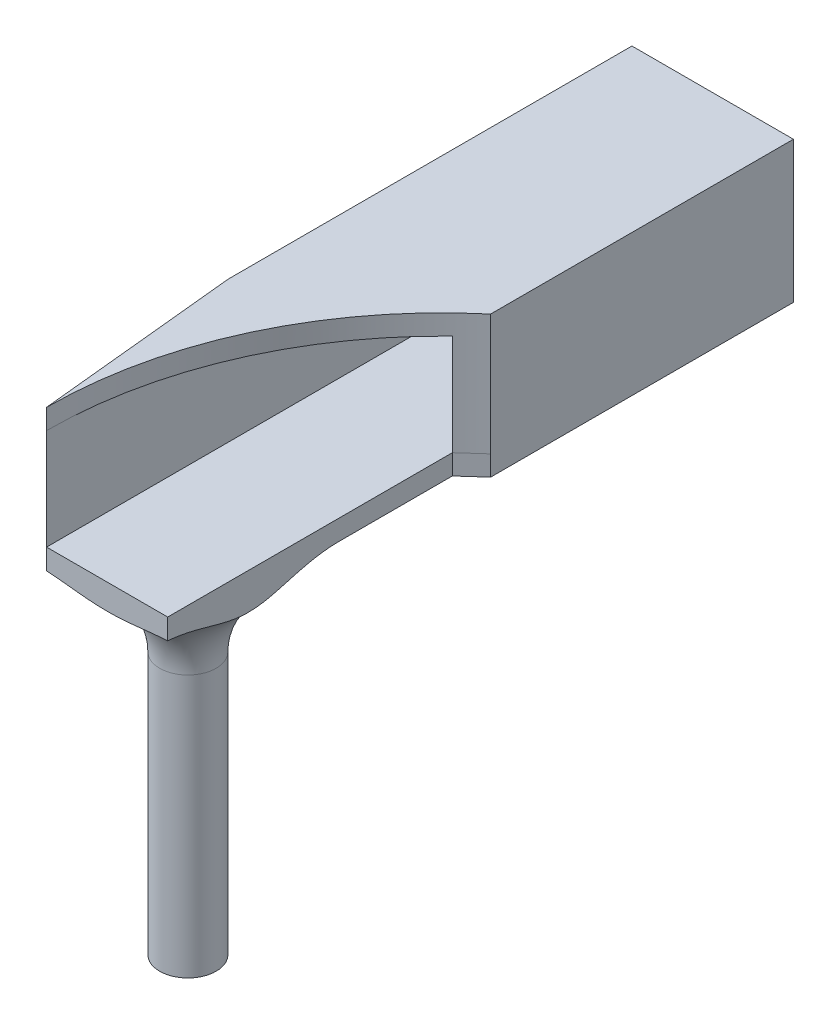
ISO-10303-21;
HEADER;
FILE_DESCRIPTION(('STEP AP214'),'2;1');
FILE_NAME('part.step','',(''),(''),'','','');
FILE_SCHEMA(('AUTOMOTIVE_DESIGN { 1 0 10303 214 1 1 1 1 }'));
ENDSEC;
DATA;
#1=APPLICATION_CONTEXT('core data for automotive mechanical design processes');
#2=APPLICATION_PROTOCOL_DEFINITION('international standard','automotive_design',2000,#1);
#3=PRODUCT_CONTEXT('',#1,'mechanical');
#4=PRODUCT('Part','Part','',(#3));
#5=PRODUCT_RELATED_PRODUCT_CATEGORY('part','',(#4));
#6=PRODUCT_DEFINITION_FORMATION('','',#4);
#7=PRODUCT_DEFINITION_CONTEXT('part definition',#1,'design');
#8=PRODUCT_DEFINITION('design','',#6,#7);
#9=PRODUCT_DEFINITION_SHAPE('','',#8);
#10=(LENGTH_UNIT() NAMED_UNIT(*) SI_UNIT(.MILLI.,.METRE.));
#11=(NAMED_UNIT(*) PLANE_ANGLE_UNIT() SI_UNIT($,.RADIAN.));
#12=(NAMED_UNIT(*) SI_UNIT($,.STERADIAN.) SOLID_ANGLE_UNIT());
#13=UNCERTAINTY_MEASURE_WITH_UNIT(LENGTH_MEASURE(1.E-05),#10,'distance_accuracy_value','');
#14=(GEOMETRIC_REPRESENTATION_CONTEXT(3) GLOBAL_UNCERTAINTY_ASSIGNED_CONTEXT((#13)) GLOBAL_UNIT_ASSIGNED_CONTEXT((#10,
#11,#12)) REPRESENTATION_CONTEXT('',''));
#15=CARTESIAN_POINT('',(0.,0.,0.));
#16=DIRECTION('',(0.,0.,1.));
#17=DIRECTION('',(1.,0.,0.));
#18=AXIS2_PLACEMENT_3D('',#15,#16,#17);
#19=CARTESIAN_POINT('',(-1.99999999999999,-1.75,15.));
#20=DIRECTION('',(0.,1.,0.));
#21=DIRECTION('',(0.,0.,1.));
#22=AXIS2_PLACEMENT_3D('',#19,#20,#21);
#23=PLANE('',#22);
#24=DIRECTION('',(0.,0.,-1.));
#25=VECTOR('',#24,1.);
#26=CARTESIAN_POINT('',(1.5,-1.75,7.94916418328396));
#27=LINE('',#26,#25);
#28=CARTESIAN_POINT('',(1.5,-1.75,10.7550055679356));
#29=VERTEX_POINT('',#28);
#30=CARTESIAN_POINT('',(1.5,-1.75,7.94916418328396));
#31=VERTEX_POINT('',#30);
#32=EDGE_CURVE('E149',#29,#31,#27,.T.);
#33=ORIENTED_EDGE('',*,*,#32,.F.);
#34=CARTESIAN_POINT('',(0.,-1.75,13.));
#35=DIRECTION('',(0.,1.,0.));
#36=DIRECTION('',(0.,0.,1.));
#37=AXIS2_PLACEMENT_3D('',#34,#35,#36);
#38=CIRCLE('',#37,2.7);
#39=CARTESIAN_POINT('',(-1.89256665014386,-1.75,11.0743334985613));
#40=VERTEX_POINT('',#39);
#41=EDGE_CURVE('E245',#29,#40,#38,.T.);
#42=ORIENTED_EDGE('',*,*,#41,.T.);
#43=DIRECTION('',(0.0995037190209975,0.,0.995037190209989));
#44=VECTOR('',#43,1.);
#45=CARTESIAN_POINT('',(-1.99999999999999,-1.75,9.99999999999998));
#46=LINE('',#45,#44);
#47=CARTESIAN_POINT('',(-1.99999999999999,-1.75,9.99999999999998));
#48=VERTEX_POINT('',#47);
#49=EDGE_CURVE('E310',#48,#40,#46,.T.);
#50=ORIENTED_EDGE('',*,*,#49,.F.);
#51=DIRECTION('',(0.,0.,-1.));
#52=VECTOR('',#51,1.);
#53=CARTESIAN_POINT('',(-1.99999999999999,-1.75,15.));
#54=LINE('',#53,#52);
#55=CARTESIAN_POINT('',(-1.99999999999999,-1.75,0.));
#56=VERTEX_POINT('',#55);
#57=EDGE_CURVE('E262',#48,#56,#54,.T.);
#58=ORIENTED_EDGE('',*,*,#57,.T.);
#59=DIRECTION('',(1.,0.,0.));
#60=VECTOR('',#59,1.);
#61=CARTESIAN_POINT('',(-1.99999999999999,-1.75,0.));
#62=LINE('',#61,#60);
#63=CARTESIAN_POINT('',(2.00000000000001,-1.75,0.));
#64=VERTEX_POINT('',#63);
#65=EDGE_CURVE('E302',#56,#64,#62,.T.);
#66=ORIENTED_EDGE('',*,*,#65,.T.);
#67=DIRECTION('',(0.,0.,-1.));
#68=VECTOR('',#67,1.);
#69=CARTESIAN_POINT('',(2.00000000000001,-1.75,15.));
#70=LINE('',#69,#68);
#71=CARTESIAN_POINT('',(2.00000000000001,-1.75,7.5));
#72=VERTEX_POINT('',#71);
#73=EDGE_CURVE('E305',#72,#64,#70,.T.);
#74=ORIENTED_EDGE('',*,*,#73,.F.);
#75=DIRECTION('',(0.743912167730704,0.,-0.668277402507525));
#76=VECTOR('',#75,1.);
#77=CARTESIAN_POINT('',(2.00000000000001,-1.75,7.5));
#78=LINE('',#77,#76);
#79=EDGE_CURVE('E319',#31,#72,#78,.T.);
#80=ORIENTED_EDGE('',*,*,#79,.F.);
#81=EDGE_LOOP('',(#33,#42,#50,#58,#66,#74,#80));
#82=FACE_BOUND('',#81,.T.);
#83=ADVANCED_FACE('F52',(#82),#23,.F.);
#84=CARTESIAN_POINT('',(-1.5,-1.25,15.));
#85=DIRECTION('',(0.,1.,0.));
#86=DIRECTION('',(0.,0.,1.));
#87=AXIS2_PLACEMENT_3D('',#84,#85,#86);
#88=PLANE('',#87);
#89=DIRECTION('',(0.,0.,1.));
#90=VECTOR('',#89,1.);
#91=CARTESIAN_POINT('',(1.5,-1.25,7.94916418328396));
#92=LINE('',#91,#90);
#93=CARTESIAN_POINT('',(1.5,-1.25,7.94916418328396));
#94=VERTEX_POINT('',#93);
#95=CARTESIAN_POINT('',(1.5,-1.25,15.));
#96=VERTEX_POINT('',#95);
#97=EDGE_CURVE('E147',#94,#96,#92,.T.);
#98=ORIENTED_EDGE('',*,*,#97,.F.);
#99=DIRECTION('',(0.,0.,-1.));
#100=VECTOR('',#99,1.);
#101=CARTESIAN_POINT('',(1.5,-1.25,15.));
#102=LINE('',#101,#100);
#103=CARTESIAN_POINT('',(1.5,-1.25,0.));
#104=VERTEX_POINT('',#103);
#105=EDGE_CURVE('E171',#94,#104,#102,.T.);
#106=ORIENTED_EDGE('',*,*,#105,.T.);
#107=DIRECTION('',(1.,0.,0.));
#108=VECTOR('',#107,1.);
#109=CARTESIAN_POINT('',(-1.5,-1.25,0.));
#110=LINE('',#109,#108);
#111=CARTESIAN_POINT('',(-1.5,-1.25,0.));
#112=VERTEX_POINT('',#111);
#113=EDGE_CURVE('E281',#112,#104,#110,.T.);
#114=ORIENTED_EDGE('',*,*,#113,.F.);
#115=DIRECTION('',(0.,0.,-1.));
#116=VECTOR('',#115,1.);
#117=CARTESIAN_POINT('',(-1.5,-1.25,15.));
#118=LINE('',#117,#116);
#119=CARTESIAN_POINT('',(-1.5,-1.25,15.));
#120=VERTEX_POINT('',#119);
#121=EDGE_CURVE('E189',#120,#112,#118,.T.);
#122=ORIENTED_EDGE('',*,*,#121,.F.);
#123=DIRECTION('',(1.,0.,0.));
#124=VECTOR('',#123,1.);
#125=CARTESIAN_POINT('',(-1.5,-1.25,15.));
#126=LINE('',#125,#124);
#127=EDGE_CURVE('E174',#120,#96,#126,.T.);
#128=ORIENTED_EDGE('',*,*,#127,.T.);
#129=EDGE_LOOP('',(#98,#106,#114,#122,#128));
#130=FACE_BOUND('',#129,.T.);
#131=ADVANCED_FACE('F168',(#130),#88,.T.);
#132=CARTESIAN_POINT('',(0.,0.,15.));
#133=DIRECTION('',(0.,0.,-1.));
#134=DIRECTION('',(-1.,0.,0.));
#135=AXIS2_PLACEMENT_3D('',#132,#133,#134);
#136=PLANE('',#135);
#137=DIRECTION('',(0.,1.,0.));
#138=VECTOR('',#137,1.);
#139=CARTESIAN_POINT('',(-1.5,-9.26664818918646,15.));
#140=LINE('',#139,#138);
#141=CARTESIAN_POINT('',(-1.5,-1.76002512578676,15.));
#142=VERTEX_POINT('',#141);
#143=EDGE_CURVE('E78',#142,#120,#140,.T.);
#144=ORIENTED_EDGE('',*,*,#143,.F.);
#145=CARTESIAN_POINT('',(-1.5,-1.76002512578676,15.));
#146=CARTESIAN_POINT('',(-1.44749116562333,-1.76318827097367,15.));
#147=CARTESIAN_POINT('',(-1.39502842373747,-1.7670047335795,15.));
#148=CARTESIAN_POINT('',(-1.29019303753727,-1.77560362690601,15.));
#149=CARTESIAN_POINT('',(-1.23782037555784,-1.78038583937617,15.));
#150=CARTESIAN_POINT('',(-1.08069813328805,-1.79568283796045,15.));
#151=CARTESIAN_POINT('',(-0.976045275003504,-1.80714059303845,15.));
#152=CARTESIAN_POINT('',(-0.767214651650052,-1.829520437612,15.));
#153=CARTESIAN_POINT('',(-0.66303715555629,-1.8404449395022,15.));
#154=CARTESIAN_POINT('',(-0.454415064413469,-1.85884743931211,15.));
#155=CARTESIAN_POINT('',(-0.349970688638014,-1.86632768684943,15.));
#156=CARTESIAN_POINT('',(-0.140760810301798,-1.87560473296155,15.));
#157=CARTESIAN_POINT('',(-0.0359951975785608,-1.87739929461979,15.));
#158=CARTESIAN_POINT('',(0.173473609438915,-1.87472029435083,15.));
#159=CARTESIAN_POINT('',(0.278176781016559,-1.87024513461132,15.));
#160=CARTESIAN_POINT('',(0.487207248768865,-1.85643734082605,15.));
#161=CARTESIAN_POINT('',(0.591534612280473,-1.8471056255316,15.));
#162=CARTESIAN_POINT('',(0.799959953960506,-1.82626937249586,15.));
#163=CARTESIAN_POINT('',(0.904057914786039,-1.81476467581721,15.));
#164=CARTESIAN_POINT('',(1.04910206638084,-1.79932440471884,15.));
#165=CARTESIAN_POINT('',(1.09000941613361,-1.79503500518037,15.));
#166=CARTESIAN_POINT('',(1.17184436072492,-1.78676159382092,15.));
#167=CARTESIAN_POINT('',(1.2127719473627,-1.78277750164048,15.));
#168=CARTESIAN_POINT('',(1.29471078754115,-1.77528064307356,15.));
#169=CARTESIAN_POINT('',(1.3357220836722,-1.77176833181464,15.));
#170=CARTESIAN_POINT('',(1.41781326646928,-1.76537906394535,15.));
#171=CARTESIAN_POINT('',(1.4588931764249,-1.76250240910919,15.));
#172=CARTESIAN_POINT('',(1.5,-1.76002512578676,15.));
#173=B_SPLINE_CURVE_WITH_KNOTS('',3,(#145,#146,#147,#148,#149,#150,#151,#152,#153,#154,#155,
#156,#157,#158,#159,#160,#161,#162,#163,#164,#165,#166,#167,#168,#169,#170,#171,#172),
.UNSPECIFIED.,.F.,.F.,(4,2,2,2,2,2,2,2,2,2,2,2,2,4),(0.,0.157798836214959,0.315562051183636,
0.631392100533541,0.945627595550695,1.2596575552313,1.57381104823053,1.88804461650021,
2.20221876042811,2.51641589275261,2.63981004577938,2.76317160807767,2.88665133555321,
3.01018955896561),.UNSPECIFIED.);
#174=CARTESIAN_POINT('',(1.5,-1.76002512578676,15.));
#175=VERTEX_POINT('',#174);
#176=EDGE_CURVE('E65',#142,#175,#173,.T.);
#177=ORIENTED_EDGE('',*,*,#176,.T.);
#178=DIRECTION('',(0.,1.,0.));
#179=VECTOR('',#178,1.);
#180=CARTESIAN_POINT('',(1.5,-9.26664818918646,15.));
#181=LINE('',#180,#179);
#182=EDGE_CURVE('E71',#175,#96,#181,.T.);
#183=ORIENTED_EDGE('',*,*,#182,.T.);
#184=ORIENTED_EDGE('',*,*,#127,.F.);
#185=EDGE_LOOP('',(#144,#177,#183,#184));
#186=FACE_BOUND('',#185,.T.);
#187=ADVANCED_FACE('F221',(#186),#136,.F.);
#188=CARTESIAN_POINT('',(0.,0.,0.));
#189=DIRECTION('',(0.,0.,-1.));
#190=DIRECTION('',(-1.,0.,0.));
#191=AXIS2_PLACEMENT_3D('',#188,#189,#190);
#192=PLANE('',#191);
#193=DIRECTION('',(0.,1.,0.));
#194=VECTOR('',#193,1.);
#195=CARTESIAN_POINT('',(2.00000000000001,-1.75,0.));
#196=LINE('',#195,#194);
#197=CARTESIAN_POINT('',(2.00000000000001,1.75,0.));
#198=VERTEX_POINT('',#197);
#199=EDGE_CURVE('E294',#64,#198,#196,.T.);
#200=ORIENTED_EDGE('',*,*,#199,.F.);
#201=ORIENTED_EDGE('',*,*,#65,.F.);
#202=DIRECTION('',(0.,-1.,0.));
#203=VECTOR('',#202,1.);
#204=CARTESIAN_POINT('',(-1.99999999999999,-1.75,0.));
#205=LINE('',#204,#203);
#206=CARTESIAN_POINT('',(-1.99999999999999,1.75,0.));
#207=VERTEX_POINT('',#206);
#208=EDGE_CURVE('E299',#207,#56,#205,.T.);
#209=ORIENTED_EDGE('',*,*,#208,.F.);
#210=DIRECTION('',(-1.,0.,0.));
#211=VECTOR('',#210,1.);
#212=CARTESIAN_POINT('',(-1.99999999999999,1.75,0.));
#213=LINE('',#212,#211);
#214=EDGE_CURVE('E297',#198,#207,#213,.T.);
#215=ORIENTED_EDGE('',*,*,#214,.F.);
#216=EDGE_LOOP('',(#200,#201,#209,#215));
#217=FACE_BOUND('',#216,.T.);
#218=ORIENTED_EDGE('',*,*,#113,.T.);
#219=DIRECTION('',(0.,1.,0.));
#220=VECTOR('',#219,1.);
#221=CARTESIAN_POINT('',(1.5,-1.25,0.));
#222=LINE('',#221,#220);
#223=CARTESIAN_POINT('',(1.5,1.25,0.));
#224=VERTEX_POINT('',#223);
#225=EDGE_CURVE('E184',#104,#224,#222,.T.);
#226=ORIENTED_EDGE('',*,*,#225,.T.);
#227=DIRECTION('',(-1.,0.,0.));
#228=VECTOR('',#227,1.);
#229=CARTESIAN_POINT('',(-1.5,1.25,0.));
#230=LINE('',#229,#228);
#231=CARTESIAN_POINT('',(-1.5,1.25,0.));
#232=VERTEX_POINT('',#231);
#233=EDGE_CURVE('E284',#224,#232,#230,.T.);
#234=ORIENTED_EDGE('',*,*,#233,.T.);
#235=DIRECTION('',(0.,-1.,0.));
#236=VECTOR('',#235,1.);
#237=CARTESIAN_POINT('',(-1.5,-1.25,0.));
#238=LINE('',#237,#236);
#239=EDGE_CURVE('E287',#232,#112,#238,.T.);
#240=ORIENTED_EDGE('',*,*,#239,.T.);
#241=EDGE_LOOP('',(#218,#226,#234,#240));
#242=FACE_BOUND('',#241,.T.);
#243=ADVANCED_FACE('F235',(#217,#242),#192,.T.);
#244=CARTESIAN_POINT('',(2.00000000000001,-1.75,15.));
#245=DIRECTION('',(-1.,0.,0.));
#246=DIRECTION('',(0.,0.,1.));
#247=AXIS2_PLACEMENT_3D('',#244,#245,#246);
#248=PLANE('',#247);
#249=DIRECTION('',(0.,1.,0.));
#250=VECTOR('',#249,1.);
#251=CARTESIAN_POINT('',(2.00000000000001,-9.52647267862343,7.5));
#252=LINE('',#251,#250);
#253=CARTESIAN_POINT('',(2.00000000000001,-1.25,7.5));
#254=VERTEX_POINT('',#253);
#255=CARTESIAN_POINT('',(2.00000000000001,1.75,7.5));
#256=VERTEX_POINT('',#255);
#257=EDGE_CURVE('E266',#254,#256,#252,.T.);
#258=ORIENTED_EDGE('',*,*,#257,.F.);
#259=DIRECTION('',(0.,1.,0.));
#260=VECTOR('',#259,1.);
#261=CARTESIAN_POINT('',(2.00000000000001,-9.26664818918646,7.5));
#262=LINE('',#261,#260);
#263=EDGE_CURVE('E152',#72,#254,#262,.T.);
#264=ORIENTED_EDGE('',*,*,#263,.F.);
#265=ORIENTED_EDGE('',*,*,#73,.T.);
#266=ORIENTED_EDGE('',*,*,#199,.T.);
#267=DIRECTION('',(0.,0.,-1.));
#268=VECTOR('',#267,1.);
#269=CARTESIAN_POINT('',(2.00000000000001,1.75,15.));
#270=LINE('',#269,#268);
#271=EDGE_CURVE('E252',#256,#198,#270,.T.);
#272=ORIENTED_EDGE('',*,*,#271,.F.);
#273=EDGE_LOOP('',(#258,#264,#265,#266,#272));
#274=FACE_BOUND('',#273,.T.);
#275=ADVANCED_FACE('F318',(#274),#248,.F.);
#276=CARTESIAN_POINT('',(-1.99999999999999,1.75,15.));
#277=DIRECTION('',(0.,-1.,0.));
#278=DIRECTION('',(0.,0.,-1.));
#279=AXIS2_PLACEMENT_3D('',#276,#277,#278);
#280=PLANE('',#279);
#281=DIRECTION('',(0.,0.,-1.));
#282=VECTOR('',#281,1.);
#283=CARTESIAN_POINT('',(-1.99999999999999,1.75,15.));
#284=LINE('',#283,#282);
#285=CARTESIAN_POINT('',(-1.99999999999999,1.75,9.99999999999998));
#286=VERTEX_POINT('',#285);
#287=EDGE_CURVE('E255',#286,#207,#284,.T.);
#288=ORIENTED_EDGE('',*,*,#287,.F.);
#289=DIRECTION('',(-0.0995037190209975,0.,-0.995037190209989));
#290=VECTOR('',#289,1.);
#291=CARTESIAN_POINT('',(-2.97029702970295,1.75,0.297029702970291));
#292=LINE('',#291,#290);
#293=CARTESIAN_POINT('',(-1.5,1.75,15.));
#294=VERTEX_POINT('',#293);
#295=EDGE_CURVE('E273',#294,#286,#292,.T.);
#296=ORIENTED_EDGE('',*,*,#295,.F.);
#297=CARTESIAN_POINT('',(8.28571428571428,1.75,15.));
#298=DIRECTION('',(0.,1.,0.));
#299=DIRECTION('',(0.,0.,1.));
#300=AXIS2_PLACEMENT_3D('',#297,#298,#299);
#301=CIRCLE('',#300,9.78571428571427);
#302=EDGE_CURVE('E269',#256,#294,#301,.T.);
#303=ORIENTED_EDGE('',*,*,#302,.F.);
#304=ORIENTED_EDGE('',*,*,#271,.T.);
#305=ORIENTED_EDGE('',*,*,#214,.T.);
#306=EDGE_LOOP('',(#288,#296,#303,#304,#305));
#307=FACE_BOUND('',#306,.T.);
#308=ADVANCED_FACE('F343',(#307),#280,.F.);
#309=CARTESIAN_POINT('',(-1.99999999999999,-1.75,15.));
#310=DIRECTION('',(1.,0.,0.));
#311=DIRECTION('',(0.,0.,-1.));
#312=AXIS2_PLACEMENT_3D('',#309,#310,#311);
#313=PLANE('',#312);
#314=ORIENTED_EDGE('',*,*,#57,.F.);
#315=DIRECTION('',(0.,1.,0.));
#316=VECTOR('',#315,1.);
#317=CARTESIAN_POINT('',(-1.99999999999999,-9.52647267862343,9.99999999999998));
#318=LINE('',#317,#316);
#319=EDGE_CURVE('E275',#48,#286,#318,.T.);
#320=ORIENTED_EDGE('',*,*,#319,.T.);
#321=ORIENTED_EDGE('',*,*,#287,.T.);
#322=ORIENTED_EDGE('',*,*,#208,.T.);
#323=EDGE_LOOP('',(#314,#320,#321,#322));
#324=FACE_BOUND('',#323,.T.);
#325=ADVANCED_FACE('F231',(#324),#313,.F.);
#326=CARTESIAN_POINT('',(1.5,-1.25,15.));
#327=DIRECTION('',(-1.,0.,0.));
#328=DIRECTION('',(0.,0.,1.));
#329=AXIS2_PLACEMENT_3D('',#326,#327,#328);
#330=PLANE('',#329);
#331=DIRECTION('',(0.,1.,0.));
#332=VECTOR('',#331,1.);
#333=CARTESIAN_POINT('',(1.5,-9.52647267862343,7.94916418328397));
#334=LINE('',#333,#332);
#335=CARTESIAN_POINT('',(1.5,1.25,7.94916418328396));
#336=VERTEX_POINT('',#335);
#337=EDGE_CURVE('E177',#336,#94,#334,.F.);
#338=ORIENTED_EDGE('',*,*,#337,.F.);
#339=DIRECTION('',(0.,0.,-1.));
#340=VECTOR('',#339,1.);
#341=CARTESIAN_POINT('',(1.5,1.25,15.));
#342=LINE('',#341,#340);
#343=EDGE_CURVE('E292',#336,#224,#342,.T.);
#344=ORIENTED_EDGE('',*,*,#343,.T.);
#345=ORIENTED_EDGE('',*,*,#225,.F.);
#346=ORIENTED_EDGE('',*,*,#105,.F.);
#347=EDGE_LOOP('',(#338,#344,#345,#346));
#348=FACE_BOUND('',#347,.T.);
#349=ADVANCED_FACE('F186',(#348),#330,.T.);
#350=CARTESIAN_POINT('',(-1.5,1.25,15.));
#351=DIRECTION('',(0.,-1.,0.));
#352=DIRECTION('',(0.,0.,-1.));
#353=AXIS2_PLACEMENT_3D('',#350,#351,#352);
#354=PLANE('',#353);
#355=CARTESIAN_POINT('',(8.28571428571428,1.25,15.));
#356=DIRECTION('',(0.,-1.,0.));
#357=DIRECTION('',(0.,0.,-1.));
#358=AXIS2_PLACEMENT_3D('',#355,#356,#357);
#359=CIRCLE('',#358,9.78571428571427);
#360=CARTESIAN_POINT('',(-1.5,1.25,15.));
#361=VERTEX_POINT('',#360);
#362=EDGE_CURVE('E181',#361,#336,#359,.T.);
#363=ORIENTED_EDGE('',*,*,#362,.F.);
#364=DIRECTION('',(0.,0.,-1.));
#365=VECTOR('',#364,1.);
#366=CARTESIAN_POINT('',(-1.5,1.25,15.));
#367=LINE('',#366,#365);
#368=EDGE_CURVE('E191',#361,#232,#367,.T.);
#369=ORIENTED_EDGE('',*,*,#368,.T.);
#370=ORIENTED_EDGE('',*,*,#233,.F.);
#371=ORIENTED_EDGE('',*,*,#343,.F.);
#372=EDGE_LOOP('',(#363,#369,#370,#371));
#373=FACE_BOUND('',#372,.T.);
#374=ADVANCED_FACE('F224',(#373),#354,.T.);
#375=CARTESIAN_POINT('',(-1.5,-1.25,15.));
#376=DIRECTION('',(1.,0.,0.));
#377=DIRECTION('',(0.,0.,-1.));
#378=AXIS2_PLACEMENT_3D('',#375,#376,#377);
#379=PLANE('',#378);
#380=ORIENTED_EDGE('',*,*,#239,.F.);
#381=ORIENTED_EDGE('',*,*,#368,.F.);
#382=DIRECTION('',(0.,-1.,0.));
#383=VECTOR('',#382,1.);
#384=CARTESIAN_POINT('',(-1.5,-1.25,15.));
#385=LINE('',#384,#383);
#386=EDGE_CURVE('E193',#361,#120,#385,.T.);
#387=ORIENTED_EDGE('',*,*,#386,.T.);
#388=ORIENTED_EDGE('',*,*,#121,.T.);
#389=EDGE_LOOP('',(#380,#381,#387,#388));
#390=FACE_BOUND('',#389,.T.);
#391=ADVANCED_FACE('F216',(#390),#379,.T.);
#392=CARTESIAN_POINT('',(8.28571428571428,-9.52647267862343,15.));
#393=DIRECTION('',(0.,1.,0.));
#394=DIRECTION('',(0.,0.,1.));
#395=AXIS2_PLACEMENT_3D('',#392,#393,#394);
#396=CYLINDRICAL_SURFACE('',#395,9.78571428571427);
#397=ORIENTED_EDGE('',*,*,#337,.T.);
#398=CARTESIAN_POINT('',(2.00000000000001,-1.25,7.5));
#399=DIRECTION('',(-0.743912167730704,0.,0.668277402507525));
#400=VECTOR('',#399,1.);
#401=LINE('',#398,#400);
#402=EDGE_CURVE('E155',#254,#94,#401,.T.);
#403=ORIENTED_EDGE('',*,*,#402,.F.);
#404=ORIENTED_EDGE('',*,*,#257,.T.);
#405=ORIENTED_EDGE('',*,*,#302,.T.);
#406=DIRECTION('',(0.,1.,0.));
#407=VECTOR('',#406,1.);
#408=CARTESIAN_POINT('',(-1.5,-9.52647267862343,15.));
#409=LINE('',#408,#407);
#410=EDGE_CURVE('E268',#361,#294,#409,.T.);
#411=ORIENTED_EDGE('',*,*,#410,.F.);
#412=ORIENTED_EDGE('',*,*,#362,.T.);
#413=EDGE_LOOP('',(#397,#403,#404,#405,#411,#412));
#414=FACE_BOUND('',#413,.T.);
#415=ADVANCED_FACE('F178',(#414),#396,.F.);
#416=CARTESIAN_POINT('',(-2.97029702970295,-9.52647267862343,0.297029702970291));
#417=DIRECTION('',(0.995037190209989,0.,-0.0995037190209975));
#418=DIRECTION('',(-0.0995037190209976,0.,-0.995037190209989));
#419=AXIS2_PLACEMENT_3D('',#416,#417,#418);
#420=PLANE('',#419);
#421=ORIENTED_EDGE('',*,*,#319,.F.);
#422=ORIENTED_EDGE('',*,*,#49,.T.);
#423=CARTESIAN_POINT('',(-1.89256665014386,-1.75,11.0743334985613));
#424=CARTESIAN_POINT('',(-1.88756723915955,-1.74999723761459,11.1243276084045));
#425=CARTESIAN_POINT('',(-1.88256902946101,-1.75115050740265,11.1743097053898));
#426=CARTESIAN_POINT('',(-1.87258408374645,-1.75554766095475,11.2741591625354));
#427=CARTESIAN_POINT('',(-1.86759734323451,-1.75879049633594,11.3240265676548));
#428=CARTESIAN_POINT('',(-1.85270236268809,-1.77128819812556,11.472976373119));
#429=CARTESIAN_POINT('',(-1.84281713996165,-1.78331602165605,11.5718286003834));
#430=CARTESIAN_POINT('',(-1.82306681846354,-1.81275699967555,11.7693318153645));
#431=CARTESIAN_POINT('',(-1.81320226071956,-1.83020438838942,11.8679773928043));
#432=CARTESIAN_POINT('',(-1.79351143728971,-1.86779781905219,12.0648856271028));
#433=CARTESIAN_POINT('',(-1.78368525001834,-1.88794782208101,12.1631474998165));
#434=CARTESIAN_POINT('',(-1.76403113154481,-1.92754252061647,12.3596886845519));
#435=CARTESIAN_POINT('',(-1.7542032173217,-1.94698805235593,12.4579678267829));
#436=CARTESIAN_POINT('',(-1.73446848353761,-1.98110093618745,12.6553151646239));
#437=CARTESIAN_POINT('',(-1.72456176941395,-1.99577383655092,12.7543823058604));
#438=CARTESIAN_POINT('',(-1.7096425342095,-2.01124330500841,12.9035746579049));
#439=CARTESIAN_POINT('',(-1.70466441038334,-2.01530903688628,12.9533558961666));
#440=CARTESIAN_POINT('',(-1.694694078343,-2.02095630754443,13.05305921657));
#441=CARTESIAN_POINT('',(-1.68970187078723,-2.02253796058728,13.1029812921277));
#442=CARTESIAN_POINT('',(-1.67971672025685,-2.02307454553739,13.2028327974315));
#443=CARTESIAN_POINT('',(-1.67472377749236,-2.02202985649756,13.2527622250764));
#444=CARTESIAN_POINT('',(-1.66474974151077,-2.01740849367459,13.3525025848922));
#445=CARTESIAN_POINT('',(-1.65976864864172,-2.01383174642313,13.4023135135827));
#446=CARTESIAN_POINT('',(-1.64839848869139,-2.00308906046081,13.516015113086));
#447=CARTESIAN_POINT('',(-1.64201643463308,-1.9951867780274,13.5798356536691));
#448=CARTESIAN_POINT('',(-1.62929240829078,-1.97663379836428,13.7070759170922));
#449=CARTESIAN_POINT('',(-1.62295044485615,-1.96598251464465,13.7704955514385));
#450=CARTESIAN_POINT('',(-1.61028432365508,-1.9430186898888,13.8971567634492));
#451=CARTESIAN_POINT('',(-1.6039602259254,-1.93070290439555,13.960397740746));
#452=CARTESIAN_POINT('',(-1.59132326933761,-1.90549802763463,14.0867673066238));
#453=CARTESIAN_POINT('',(-1.58501041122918,-1.89260889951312,14.1498958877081));
#454=CARTESIAN_POINT('',(-1.57218102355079,-1.86682758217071,14.278189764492));
#455=CARTESIAN_POINT('',(-1.56566424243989,-1.85394766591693,14.343357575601));
#456=CARTESIAN_POINT('',(-1.55260721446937,-1.82952112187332,14.4739278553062));
#457=CARTESIAN_POINT('',(-1.54606697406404,-1.81797415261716,14.5393302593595));
#458=CARTESIAN_POINT('',(-1.53296143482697,-1.79702065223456,14.6703856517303));
#459=CARTESIAN_POINT('',(-1.52639618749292,-1.78761097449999,14.7360381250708));
#460=CARTESIAN_POINT('',(-1.51322591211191,-1.77156525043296,14.8677408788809));
#461=CARTESIAN_POINT('',(-1.50662085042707,-1.7649320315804,14.9337914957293));
#462=CARTESIAN_POINT('',(-1.5,-1.76002512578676,15.));
#463=B_SPLINE_CURVE_WITH_KNOTS('',3,(#423,#424,#425,#426,#427,#428,#429,#430,#431,#432,#433,
#434,#435,#436,#437,#438,#439,#440,#441,#442,#443,#444,#445,#446,#447,#448,#449,#450,#451,#452,
#453,#454,#455,#456,#457,#458,#459,#460,#461,#462),.UNSPECIFIED.,.F.,.F.,(4,2,2,2,2,2,2,2,2,2,2,
2,2,2,2,2,2,2,2,4),(0.,0.150698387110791,0.30132122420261,0.601297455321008,0.903208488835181,
1.20556695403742,1.50755389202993,1.80918849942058,1.95971658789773,2.11023775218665,
2.26073719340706,2.41124100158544,2.60502366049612,2.79884769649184,2.99305513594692,
3.18727507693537,3.38751129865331,3.58769611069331,3.78758426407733,3.9876754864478),.UNSPECIFIED.);
#464=EDGE_CURVE('E241',#40,#142,#463,.T.);
#465=ORIENTED_EDGE('',*,*,#464,.T.);
#466=ORIENTED_EDGE('',*,*,#143,.T.);
#467=ORIENTED_EDGE('',*,*,#386,.F.);
#468=ORIENTED_EDGE('',*,*,#410,.T.);
#469=ORIENTED_EDGE('',*,*,#295,.T.);
#470=EDGE_LOOP('',(#421,#422,#465,#466,#467,#468,#469));
#471=FACE_BOUND('',#470,.T.);
#472=ADVANCED_FACE('F215',(#471),#420,.F.);
#473=CARTESIAN_POINT('',(1.5,-9.26664818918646,7.94916418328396));
#474=DIRECTION('',(-1.,0.,0.));
#475=DIRECTION('',(0.,0.,1.));
#476=AXIS2_PLACEMENT_3D('',#473,#474,#475);
#477=PLANE('',#476);
#478=ORIENTED_EDGE('',*,*,#182,.F.);
#479=CARTESIAN_POINT('',(1.5,-1.76002512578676,15.));
#480=CARTESIAN_POINT('',(1.5,-1.7638416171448,14.9524999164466));
#481=CARTESIAN_POINT('',(1.5,-1.76870665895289,14.9050944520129));
#482=CARTESIAN_POINT('',(1.5,-1.78033549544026,14.810537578));
#483=CARTESIAN_POINT('',(1.5,-1.78709842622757,14.7633860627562));
#484=CARTESIAN_POINT('',(1.5,-1.80988271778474,14.6227205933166));
#485=CARTESIAN_POINT('',(1.5,-1.82843324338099,14.5296156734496));
#486=CARTESIAN_POINT('',(1.5,-1.87112038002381,14.3412857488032));
#487=CARTESIAN_POINT('',(1.5,-1.89543116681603,14.246102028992));
#488=CARTESIAN_POINT('',(1.5,-1.94655916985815,14.0563076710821));
#489=CARTESIAN_POINT('',(1.5,-1.9733795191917,13.9616979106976));
#490=CARTESIAN_POINT('',(1.5,-2.02146020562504,13.7878267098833));
#491=CARTESIAN_POINT('',(1.5,-2.04290570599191,13.7086184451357));
#492=CARTESIAN_POINT('',(1.5,-2.08209709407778,13.5492904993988));
#493=CARTESIAN_POINT('',(1.5,-2.09984500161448,13.4691713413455));
#494=CARTESIAN_POINT('',(1.5,-2.12800231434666,13.3092502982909));
#495=CARTESIAN_POINT('',(1.5,-2.13855594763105,13.2294761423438));
#496=CARTESIAN_POINT('',(1.5,-2.14741504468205,13.1093307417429));
#497=CARTESIAN_POINT('',(1.5,-2.14920655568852,13.0692104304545));
#498=CARTESIAN_POINT('',(1.5,-2.15037093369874,12.9889361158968));
#499=CARTESIAN_POINT('',(1.5,-2.14974394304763,12.9487821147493));
#500=CARTESIAN_POINT('',(1.5,-2.14520908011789,12.8490296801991));
#501=CARTESIAN_POINT('',(1.5,-2.13985082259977,12.789494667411));
#502=CARTESIAN_POINT('',(1.5,-2.12461628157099,12.6710130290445));
#503=CARTESIAN_POINT('',(1.5,-2.11473813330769,12.6120666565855));
#504=CARTESIAN_POINT('',(1.5,-2.09146979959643,12.4937226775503));
#505=CARTESIAN_POINT('',(1.5,-2.07801602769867,12.4343380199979));
#506=CARTESIAN_POINT('',(1.5,-2.04902956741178,12.3160723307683));
#507=CARTESIAN_POINT('',(1.5,-2.03349614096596,12.2571914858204));
#508=CARTESIAN_POINT('',(1.5,-2.00115267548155,12.1382109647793));
#509=CARTESIAN_POINT('',(1.5,-1.98432047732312,12.0781174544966));
#510=CARTESIAN_POINT('',(1.5,-1.95080451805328,11.9578864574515));
#511=CARTESIAN_POINT('',(1.5,-1.93412076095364,11.8977489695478));
#512=CARTESIAN_POINT('',(1.5,-1.9018081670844,11.7772919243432));
#513=CARTESIAN_POINT('',(1.5,-1.88617764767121,11.7169728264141));
#514=CARTESIAN_POINT('',(1.5,-1.85667022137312,11.5959088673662));
#515=CARTESIAN_POINT('',(1.5,-1.84279308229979,11.5351640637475));
#516=CARTESIAN_POINT('',(1.5,-1.81783966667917,11.4152708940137));
#517=CARTESIAN_POINT('',(1.5,-1.80668354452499,11.3561393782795));
#518=CARTESIAN_POINT('',(1.5,-1.78705192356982,11.2374402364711));
#519=CARTESIAN_POINT('',(1.5,-1.77857584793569,11.1778727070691));
#520=CARTESIAN_POINT('',(1.5,-1.76466058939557,11.0578937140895));
#521=CARTESIAN_POINT('',(1.5,-1.75924615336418,10.9974793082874));
#522=CARTESIAN_POINT('',(1.5,-1.75190947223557,10.8763858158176));
#523=CARTESIAN_POINT('',(1.5,-1.7499904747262,10.8157065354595));
#524=CARTESIAN_POINT('',(1.5,-1.75,10.7550055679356));
#525=B_SPLINE_CURVE_WITH_KNOTS('',3,(#479,#480,#481,#482,#483,#484,#485,#486,#487,#488,#489,
#490,#491,#492,#493,#494,#495,#496,#497,#498,#499,#500,#501,#502,#503,#504,#505,#506,#507,#508,
#509,#510,#511,#512,#513,#514,#515,#516,#517,#518,#519,#520,#521,#522,#523,#524),.UNSPECIFIED.,
.F.,.F.,(4,2,2,2,2,2,2,2,2,2,2,2,2,2,2,2,2,2,2,2,2,2,4),(0.,0.142931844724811,0.285798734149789,
0.570390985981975,0.865036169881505,1.16005424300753,1.40621105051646,1.65223303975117,
1.89316513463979,2.01357838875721,2.13398455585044,2.31308709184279,2.49226358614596,
2.67486865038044,2.85753869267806,3.04475807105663,3.23198249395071,3.41890034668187,
3.60579342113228,3.78626571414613,3.9666991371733,4.14857086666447,4.33061148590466),.UNSPECIFIED.);
#526=EDGE_CURVE('E12',#175,#29,#525,.T.);
#527=ORIENTED_EDGE('',*,*,#526,.T.);
#528=ORIENTED_EDGE('',*,*,#32,.T.);
#529=DIRECTION('',(0.,1.,0.));
#530=VECTOR('',#529,1.);
#531=CARTESIAN_POINT('',(1.5,-9.26664818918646,7.94916418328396));
#532=LINE('',#531,#530);
#533=EDGE_CURVE('E143',#31,#94,#532,.T.);
#534=ORIENTED_EDGE('',*,*,#533,.T.);
#535=ORIENTED_EDGE('',*,*,#97,.T.);
#536=EDGE_LOOP('',(#478,#527,#528,#534,#535));
#537=FACE_BOUND('',#536,.T.);
#538=ADVANCED_FACE('F145',(#537),#477,.F.);
#539=CARTESIAN_POINT('',(2.00000000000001,-9.26664818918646,7.5));
#540=DIRECTION('',(-0.668277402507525,0.,-0.743912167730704));
#541=DIRECTION('',(-0.743912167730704,0.,0.668277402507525));
#542=AXIS2_PLACEMENT_3D('',#539,#540,#541);
#543=PLANE('',#542);
#544=ORIENTED_EDGE('',*,*,#79,.T.);
#545=ORIENTED_EDGE('',*,*,#263,.T.);
#546=ORIENTED_EDGE('',*,*,#402,.T.);
#547=ORIENTED_EDGE('',*,*,#533,.F.);
#548=EDGE_LOOP('',(#544,#545,#546,#547));
#549=FACE_BOUND('',#548,.T.);
#550=ADVANCED_FACE('F157',(#549),#543,.F.);
#551=CARTESIAN_POINT('',(0.,-10.25,13.));
#552=DIRECTION('',(0.,1.,0.));
#553=DIRECTION('',(0.,0.,1.));
#554=AXIS2_PLACEMENT_3D('',#551,#552,#553);
#555=CYLINDRICAL_SURFACE('',#554,0.7);
#556=CARTESIAN_POINT('',(0.,-3.75,13.));
#557=DIRECTION('',(0.,1.,0.));
#558=DIRECTION('',(0.,0.,1.));
#559=AXIS2_PLACEMENT_3D('',#556,#557,#558);
#560=CIRCLE('',#559,0.7);
#561=CARTESIAN_POINT('',(0.,-3.75,13.7));
#562=VERTEX_POINT('',#561);
#563=EDGE_CURVE('E204',#562,#562,#560,.F.);
#564=ORIENTED_EDGE('',*,*,#563,.T.);
#565=EDGE_LOOP('',(#564));
#566=FACE_BOUND('',#565,.T.);
#567=CARTESIAN_POINT('',(0.,-10.25,13.));
#568=DIRECTION('',(0.,-1.,0.));
#569=DIRECTION('',(0.,0.,-1.));
#570=AXIS2_PLACEMENT_3D('',#567,#568,#569);
#571=CIRCLE('',#570,0.7);
#572=CARTESIAN_POINT('',(0.,-10.25,12.3));
#573=VERTEX_POINT('',#572);
#574=EDGE_CURVE('E163',#573,#573,#571,.T.);
#575=ORIENTED_EDGE('',*,*,#574,.F.);
#576=EDGE_LOOP('',(#575));
#577=FACE_BOUND('',#576,.T.);
#578=ADVANCED_FACE('F329',(#566,#577),#555,.T.);
#579=CARTESIAN_POINT('',(0.,-10.25,13.));
#580=DIRECTION('',(0.,-1.,0.));
#581=DIRECTION('',(0.,0.,-1.));
#582=AXIS2_PLACEMENT_3D('',#579,#580,#581);
#583=PLANE('',#582);
#584=ORIENTED_EDGE('',*,*,#574,.T.);
#585=EDGE_LOOP('',(#584));
#586=FACE_BOUND('',#585,.T.);
#587=ADVANCED_FACE('F327',(#586),#583,.T.);
#588=CARTESIAN_POINT('',(0.,-3.75,13.));
#589=DIRECTION('',(0.,1.,0.));
#590=DIRECTION('',(0.,0.,1.));
#591=AXIS2_PLACEMENT_3D('',#588,#589,#590);
#592=TOROIDAL_SURFACE('',#591,2.7,2.);
#593=ORIENTED_EDGE('',*,*,#464,.F.);
#594=ORIENTED_EDGE('',*,*,#41,.F.);
#595=ORIENTED_EDGE('',*,*,#526,.F.);
#596=ORIENTED_EDGE('',*,*,#176,.F.);
#597=EDGE_LOOP('',(#593,#594,#595,#596));
#598=FACE_BOUND('',#597,.T.);
#599=ORIENTED_EDGE('',*,*,#563,.F.);
#600=EDGE_LOOP('',(#599));
#601=FACE_BOUND('',#600,.T.);
#602=ADVANCED_FACE('F54',(#598,#601),#592,.F.);
#603=CLOSED_SHELL('',(#83,#131,#187,#243,#275,#308,#325,#349,#374,#391,#415,#472,#538,#550,#578,
#587,#602));
#604=MANIFOLD_SOLID_BREP('B2',#603);
#605=ADVANCED_BREP_SHAPE_REPRESENTATION('',(#18,#604),#14);
#606=SHAPE_DEFINITION_REPRESENTATION(#9,#605);
ENDSEC;
END-ISO-10303-21;
